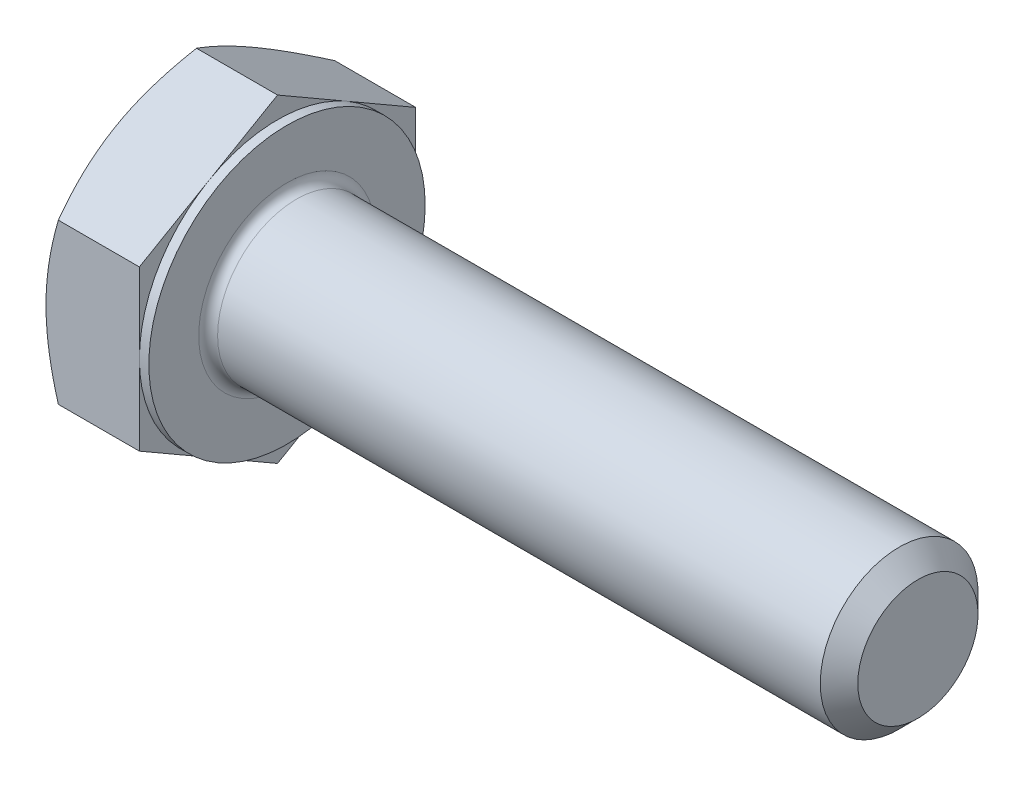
ISO-10303-21;
HEADER;
FILE_DESCRIPTION(('STEP AP214'),'2;1');
FILE_NAME('part.step','',(''),(''),'','','');
FILE_SCHEMA(('AUTOMOTIVE_DESIGN { 1 0 10303 214 1 1 1 1 }'));
ENDSEC;
DATA;
#1=APPLICATION_CONTEXT('core data for automotive mechanical design processes');
#2=APPLICATION_PROTOCOL_DEFINITION('international standard','automotive_design',2000,#1);
#3=PRODUCT_CONTEXT('',#1,'mechanical');
#4=PRODUCT('Part','Part','',(#3));
#5=PRODUCT_RELATED_PRODUCT_CATEGORY('part','',(#4));
#6=PRODUCT_DEFINITION_FORMATION('','',#4);
#7=PRODUCT_DEFINITION_CONTEXT('part definition',#1,'design');
#8=PRODUCT_DEFINITION('design','',#6,#7);
#9=PRODUCT_DEFINITION_SHAPE('','',#8);
#10=(LENGTH_UNIT() NAMED_UNIT(*) SI_UNIT(.MILLI.,.METRE.));
#11=(NAMED_UNIT(*) PLANE_ANGLE_UNIT() SI_UNIT($,.RADIAN.));
#12=(NAMED_UNIT(*) SI_UNIT($,.STERADIAN.) SOLID_ANGLE_UNIT());
#13=UNCERTAINTY_MEASURE_WITH_UNIT(LENGTH_MEASURE(1.E-05),#10,'distance_accuracy_value','');
#14=(GEOMETRIC_REPRESENTATION_CONTEXT(3) GLOBAL_UNCERTAINTY_ASSIGNED_CONTEXT((#13)) GLOBAL_UNIT_ASSIGNED_CONTEXT((#10,
#11,#12)) REPRESENTATION_CONTEXT('',''));
#15=CARTESIAN_POINT('',(0.,0.,0.));
#16=DIRECTION('',(0.,0.,1.));
#17=DIRECTION('',(1.,0.,0.));
#18=AXIS2_PLACEMENT_3D('',#15,#16,#17);
#19=CARTESIAN_POINT('',(4.1402,6.42313721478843,0.));
#20=DIRECTION('',(1.,0.,0.));
#21=DIRECTION('',(0.,0.,-1.));
#22=AXIS2_PLACEMENT_3D('',#19,#20,#21);
#23=PLANE('',#22);
#24=CARTESIAN_POINT('',(4.1402,0.,0.));
#25=DIRECTION('',(1.,0.,0.));
#26=DIRECTION('',(0.,0.,-1.));
#27=AXIS2_PLACEMENT_3D('',#24,#25,#26);
#28=CIRCLE('',#27,3.556);
#29=CARTESIAN_POINT('',(4.1402,0.,-3.556));
#30=VERTEX_POINT('',#29);
#31=EDGE_CURVE('E40',#30,#30,#28,.F.);
#32=ORIENTED_EDGE('',*,*,#31,.T.);
#33=EDGE_LOOP('',(#32));
#34=FACE_BOUND('',#33,.T.);
#35=CARTESIAN_POINT('',(4.1402,0.,0.));
#36=DIRECTION('',(1.,0.,0.));
#37=DIRECTION('',(0.,0.,-1.));
#38=AXIS2_PLACEMENT_3D('',#35,#36,#37);
#39=CIRCLE('',#38,5.5626);
#40=CARTESIAN_POINT('',(4.1402,0.,-5.5626));
#41=VERTEX_POINT('',#40);
#42=EDGE_CURVE('E291',#41,#41,#39,.T.);
#43=ORIENTED_EDGE('',*,*,#42,.T.);
#44=EDGE_LOOP('',(#43));
#45=FACE_BOUND('',#44,.T.);
#46=ADVANCED_FACE('F32',(#34,#45),#23,.T.);
#47=CARTESIAN_POINT('',(0.,0.,0.));
#48=DIRECTION('',(-1.,0.,0.));
#49=DIRECTION('',(0.,0.,1.));
#50=AXIS2_PLACEMENT_3D('',#47,#48,#49);
#51=CYLINDRICAL_SURFACE('',#50,3.175);
#52=CARTESIAN_POINT('',(4.5212,0.,0.));
#53=DIRECTION('',(1.,0.,0.));
#54=DIRECTION('',(0.,0.,-1.));
#55=AXIS2_PLACEMENT_3D('',#52,#53,#54);
#56=CIRCLE('',#55,3.175);
#57=CARTESIAN_POINT('',(4.5212,0.,-3.175));
#58=VERTEX_POINT('',#57);
#59=EDGE_CURVE('E11',#58,#58,#56,.T.);
#60=ORIENTED_EDGE('',*,*,#59,.T.);
#61=EDGE_LOOP('',(#60));
#62=FACE_BOUND('',#61,.T.);
#63=CARTESIAN_POINT('',(28.78455,0.,0.));
#64=DIRECTION('',(-1.,0.,0.));
#65=DIRECTION('',(0.,0.,1.));
#66=AXIS2_PLACEMENT_3D('',#63,#64,#65);
#67=CIRCLE('',#66,3.175);
#68=CARTESIAN_POINT('',(28.78455,0.,3.175));
#69=VERTEX_POINT('',#68);
#70=EDGE_CURVE('E270',#69,#69,#67,.T.);
#71=ORIENTED_EDGE('',*,*,#70,.T.);
#72=EDGE_LOOP('',(#71));
#73=FACE_BOUND('',#72,.T.);
#74=ADVANCED_FACE('F244',(#62,#73),#51,.T.);
#75=CARTESIAN_POINT('',(29.5402,0.,0.));
#76=DIRECTION('',(-1.,0.,0.));
#77=DIRECTION('',(0.,0.,1.));
#78=AXIS2_PLACEMENT_3D('',#75,#76,#77);
#79=CONICAL_SURFACE('',#78,2.41935,0.785398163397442);
#80=ORIENTED_EDGE('',*,*,#70,.F.);
#81=EDGE_LOOP('',(#80));
#82=FACE_BOUND('',#81,.T.);
#83=CARTESIAN_POINT('',(29.5402,0.,0.));
#84=DIRECTION('',(-1.,0.,0.));
#85=DIRECTION('',(0.,0.,1.));
#86=AXIS2_PLACEMENT_3D('',#83,#84,#85);
#87=CIRCLE('',#86,2.41935);
#88=CARTESIAN_POINT('',(29.5402,0.,2.41935));
#89=VERTEX_POINT('',#88);
#90=EDGE_CURVE('E268',#89,#89,#87,.T.);
#91=ORIENTED_EDGE('',*,*,#90,.T.);
#92=EDGE_LOOP('',(#91));
#93=FACE_BOUND('',#92,.T.);
#94=ADVANCED_FACE('F249',(#82,#93),#79,.T.);
#95=CARTESIAN_POINT('',(29.5402,0.,0.));
#96=DIRECTION('',(-1.,0.,0.));
#97=DIRECTION('',(0.,0.,1.));
#98=AXIS2_PLACEMENT_3D('',#95,#96,#97);
#99=PLANE('',#98);
#100=ORIENTED_EDGE('',*,*,#90,.F.);
#101=EDGE_LOOP('',(#100));
#102=FACE_BOUND('',#101,.T.);
#103=ADVANCED_FACE('F256',(#102),#99,.F.);
#104=CARTESIAN_POINT('',(3.7592,5.5626,0.));
#105=DIRECTION('',(1.,0.,0.));
#106=DIRECTION('',(0.,0.,-1.));
#107=AXIS2_PLACEMENT_3D('',#104,#105,#106);
#108=PLANE('',#107);
#109=DIRECTION('',(0.,0.500000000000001,0.866025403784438));
#110=VECTOR('',#109,1.);
#111=CARTESIAN_POINT('',(3.7592,3.21156860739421,-5.5626));
#112=LINE('',#111,#110);
#113=CARTESIAN_POINT('',(3.7592,3.21156860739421,-5.5626));
#114=VERTEX_POINT('',#113);
#115=CARTESIAN_POINT('',(3.7592,4.81735291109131,-2.78130000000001));
#116=VERTEX_POINT('',#115);
#117=EDGE_CURVE('E164',#114,#116,#112,.T.);
#118=ORIENTED_EDGE('',*,*,#117,.T.);
#119=CARTESIAN_POINT('',(3.7592,0.,0.));
#120=DIRECTION('',(-1.,0.,0.));
#121=DIRECTION('',(0.,0.,1.));
#122=AXIS2_PLACEMENT_3D('',#119,#120,#121);
#123=CIRCLE('',#122,5.5626);
#124=CARTESIAN_POINT('',(3.7592,0.,-5.5626));
#125=VERTEX_POINT('',#124);
#126=EDGE_CURVE('E47',#116,#125,#123,.T.);
#127=ORIENTED_EDGE('',*,*,#126,.T.);
#128=DIRECTION('',(0.,1.,0.));
#129=VECTOR('',#128,1.);
#130=CARTESIAN_POINT('',(3.7592,3.21156860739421,-5.5626));
#131=LINE('',#130,#129);
#132=EDGE_CURVE('E294',#125,#114,#131,.T.);
#133=ORIENTED_EDGE('',*,*,#132,.T.);
#134=EDGE_LOOP('',(#118,#127,#133));
#135=FACE_BOUND('',#134,.T.);
#136=ADVANCED_FACE('F259',(#135),#108,.T.);
#137=CARTESIAN_POINT('',(3.7592,6.42313721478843,0.));
#138=VERTEX_POINT('',#137);
#139=EDGE_CURVE('E162',#116,#138,#112,.T.);
#140=ORIENTED_EDGE('',*,*,#139,.T.);
#141=DIRECTION('',(0.,-0.500000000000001,0.866025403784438));
#142=VECTOR('',#141,1.);
#143=CARTESIAN_POINT('',(3.7592,6.42313721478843,0.));
#144=LINE('',#143,#142);
#145=CARTESIAN_POINT('',(3.7592,4.81735291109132,2.7813));
#146=VERTEX_POINT('',#145);
#147=EDGE_CURVE('E161',#138,#146,#144,.T.);
#148=ORIENTED_EDGE('',*,*,#147,.T.);
#149=EDGE_CURVE('E150',#146,#116,#123,.T.);
#150=ORIENTED_EDGE('',*,*,#149,.T.);
#151=EDGE_LOOP('',(#140,#148,#150));
#152=FACE_BOUND('',#151,.T.);
#153=ADVANCED_FACE('F264',(#152),#108,.T.);
#154=CARTESIAN_POINT('',(3.7592,3.21156860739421,5.5626));
#155=VERTEX_POINT('',#154);
#156=EDGE_CURVE('E129',#146,#155,#144,.T.);
#157=ORIENTED_EDGE('',*,*,#156,.T.);
#158=DIRECTION('',(0.,-1.,0.));
#159=VECTOR('',#158,1.);
#160=CARTESIAN_POINT('',(3.7592,3.21156860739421,5.5626));
#161=LINE('',#160,#159);
#162=CARTESIAN_POINT('',(3.7592,0.,5.5626));
#163=VERTEX_POINT('',#162);
#164=EDGE_CURVE('E123',#155,#163,#161,.T.);
#165=ORIENTED_EDGE('',*,*,#164,.T.);
#166=EDGE_CURVE('E127',#163,#146,#123,.T.);
#167=ORIENTED_EDGE('',*,*,#166,.T.);
#168=EDGE_LOOP('',(#157,#165,#167));
#169=FACE_BOUND('',#168,.T.);
#170=ADVANCED_FACE('F125',(#169),#108,.T.);
#171=CARTESIAN_POINT('',(3.7592,-3.2115686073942,5.5626));
#172=VERTEX_POINT('',#171);
#173=EDGE_CURVE('E133',#163,#172,#161,.T.);
#174=ORIENTED_EDGE('',*,*,#173,.T.);
#175=DIRECTION('',(0.,-0.500000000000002,-0.866025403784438));
#176=VECTOR('',#175,1.);
#177=CARTESIAN_POINT('',(3.7592,-6.42313721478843,0.));
#178=LINE('',#177,#176);
#179=CARTESIAN_POINT('',(3.7592,-4.81735291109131,2.78130000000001));
#180=VERTEX_POINT('',#179);
#181=EDGE_CURVE('E140',#172,#180,#178,.T.);
#182=ORIENTED_EDGE('',*,*,#181,.T.);
#183=EDGE_CURVE('E137',#180,#163,#123,.T.);
#184=ORIENTED_EDGE('',*,*,#183,.T.);
#185=EDGE_LOOP('',(#174,#182,#184));
#186=FACE_BOUND('',#185,.T.);
#187=ADVANCED_FACE('F138',(#186),#108,.T.);
#188=CARTESIAN_POINT('',(3.7592,-6.42313721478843,0.));
#189=VERTEX_POINT('',#188);
#190=EDGE_CURVE('E156',#180,#189,#178,.T.);
#191=ORIENTED_EDGE('',*,*,#190,.T.);
#192=DIRECTION('',(0.,0.5,-0.866025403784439));
#193=VECTOR('',#192,1.);
#194=CARTESIAN_POINT('',(3.7592,-3.21156860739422,-5.5626));
#195=LINE('',#194,#193);
#196=CARTESIAN_POINT('',(3.7592,-4.81735291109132,-2.7813));
#197=VERTEX_POINT('',#196);
#198=EDGE_CURVE('E332',#189,#197,#195,.T.);
#199=ORIENTED_EDGE('',*,*,#198,.T.);
#200=EDGE_CURVE('E144',#197,#180,#123,.T.);
#201=ORIENTED_EDGE('',*,*,#200,.T.);
#202=EDGE_LOOP('',(#191,#199,#201));
#203=FACE_BOUND('',#202,.T.);
#204=ADVANCED_FACE('F333',(#203),#108,.T.);
#205=CARTESIAN_POINT('',(3.7592,-3.21156860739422,-5.5626));
#206=VERTEX_POINT('',#205);
#207=EDGE_CURVE('E151',#197,#206,#195,.T.);
#208=ORIENTED_EDGE('',*,*,#207,.T.);
#209=EDGE_CURVE('E295',#206,#125,#131,.T.);
#210=ORIENTED_EDGE('',*,*,#209,.T.);
#211=EDGE_CURVE('E302',#125,#197,#123,.T.);
#212=ORIENTED_EDGE('',*,*,#211,.T.);
#213=EDGE_LOOP('',(#208,#210,#212));
#214=FACE_BOUND('',#213,.T.);
#215=ADVANCED_FACE('F265',(#214),#108,.T.);
#216=CARTESIAN_POINT('',(0.,0.,0.));
#217=DIRECTION('',(-1.,0.,0.));
#218=DIRECTION('',(0.,0.,1.));
#219=AXIS2_PLACEMENT_3D('',#216,#217,#218);
#220=CYLINDRICAL_SURFACE('',#219,5.5626);
#221=ORIENTED_EDGE('',*,*,#126,.F.);
#222=ORIENTED_EDGE('',*,*,#149,.F.);
#223=ORIENTED_EDGE('',*,*,#166,.F.);
#224=ORIENTED_EDGE('',*,*,#183,.F.);
#225=ORIENTED_EDGE('',*,*,#200,.F.);
#226=ORIENTED_EDGE('',*,*,#211,.F.);
#227=EDGE_LOOP('',(#221,#222,#223,#224,#225,#226));
#228=FACE_BOUND('',#227,.T.);
#229=ORIENTED_EDGE('',*,*,#42,.F.);
#230=EDGE_LOOP('',(#229));
#231=FACE_BOUND('',#230,.T.);
#232=ADVANCED_FACE('F147',(#228,#231),#220,.T.);
#233=CARTESIAN_POINT('',(0.,6.42313721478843,0.));
#234=DIRECTION('',(1.,0.,0.));
#235=DIRECTION('',(0.,0.,-1.));
#236=AXIS2_PLACEMENT_3D('',#233,#234,#235);
#237=PLANE('',#236);
#238=CARTESIAN_POINT('',(0.,0.,0.));
#239=DIRECTION('',(1.,0.,0.));
#240=DIRECTION('',(0.,0.,-1.));
#241=AXIS2_PLACEMENT_3D('',#238,#239,#240);
#242=CIRCLE('',#241,5.5626);
#243=CARTESIAN_POINT('',(0.,0.,-5.5626));
#244=VERTEX_POINT('',#243);
#245=CARTESIAN_POINT('',(0.,4.81735291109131,-2.78130000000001));
#246=VERTEX_POINT('',#245);
#247=EDGE_CURVE('E290',#244,#246,#242,.T.);
#248=ORIENTED_EDGE('',*,*,#247,.F.);
#249=CARTESIAN_POINT('',(0.,-4.81735291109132,-2.7813));
#250=VERTEX_POINT('',#249);
#251=EDGE_CURVE('E286',#250,#244,#242,.T.);
#252=ORIENTED_EDGE('',*,*,#251,.F.);
#253=CARTESIAN_POINT('',(0.,-4.81735291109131,2.78130000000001));
#254=VERTEX_POINT('',#253);
#255=EDGE_CURVE('E289',#254,#250,#242,.T.);
#256=ORIENTED_EDGE('',*,*,#255,.F.);
#257=CARTESIAN_POINT('',(0.,0.,5.5626));
#258=VERTEX_POINT('',#257);
#259=EDGE_CURVE('E325',#258,#254,#242,.T.);
#260=ORIENTED_EDGE('',*,*,#259,.F.);
#261=CARTESIAN_POINT('',(0.,0.,0.));
#262=DIRECTION('',(-1.,0.,0.));
#263=DIRECTION('',(0.,0.,1.));
#264=AXIS2_PLACEMENT_3D('',#261,#262,#263);
#265=CIRCLE('',#264,5.5626);
#266=CARTESIAN_POINT('',(0.,4.81735291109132,2.7813));
#267=VERTEX_POINT('',#266);
#268=EDGE_CURVE('E165',#258,#267,#265,.T.);
#269=ORIENTED_EDGE('',*,*,#268,.T.);
#270=EDGE_CURVE('E348',#246,#267,#242,.T.);
#271=ORIENTED_EDGE('',*,*,#270,.F.);
#272=EDGE_LOOP('',(#248,#252,#256,#260,#269,#271));
#273=FACE_BOUND('',#272,.T.);
#274=ADVANCED_FACE('F194',(#273),#237,.F.);
#275=CARTESIAN_POINT('',(0.,0.,0.));
#276=DIRECTION('',(1.,0.,0.));
#277=DIRECTION('',(0.,0.,-1.));
#278=AXIS2_PLACEMENT_3D('',#275,#276,#277);
#279=CONICAL_SURFACE('',#278,5.5626,1.0471975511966);
#280=CARTESIAN_POINT('',(0.496898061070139,3.21145313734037,5.5628));
#281=CARTESIAN_POINT('',(0.456146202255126,3.28204724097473,5.44052742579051));
#282=CARTESIAN_POINT('',(0.417243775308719,3.35290455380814,5.31779895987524));
#283=CARTESIAN_POINT('',(0.343647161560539,3.49519461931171,5.07134533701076));
#284=CARTESIAN_POINT('',(0.308954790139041,3.56662760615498,4.9476197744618));
#285=CARTESIAN_POINT('',(0.211873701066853,3.78207031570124,4.57446205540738));
#286=CARTESIAN_POINT('',(0.156654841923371,3.92693047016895,4.32355690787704));
#287=CARTESIAN_POINT('',(0.0919037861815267,4.14371105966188,3.94808191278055));
#288=CARTESIAN_POINT('',(0.0734579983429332,4.21498376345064,3.82463396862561));
#289=CARTESIAN_POINT('',(0.0425268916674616,4.3578512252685,3.57718026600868));
#290=CARTESIAN_POINT('',(0.0300410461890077,4.42944595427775,3.45317455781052));
#291=CARTESIAN_POINT('',(0.0113480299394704,4.57275976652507,3.20494775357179));
#292=CARTESIAN_POINT('',(0.00513373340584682,4.64447861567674,3.08072706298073));
#293=CARTESIAN_POINT('',(-0.000889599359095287,4.78797861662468,2.8321777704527));
#294=CARTESIAN_POINT('',(-0.000698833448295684,4.85975976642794,2.70784917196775));
#295=CARTESIAN_POINT('',(0.00862810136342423,5.05641945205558,2.36722460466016));
#296=CARTESIAN_POINT('',(0.0242873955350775,5.18123362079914,2.15104012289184));
#297=CARTESIAN_POINT('',(0.0739443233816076,5.4300329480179,1.72010704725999));
#298=CARTESIAN_POINT('',(0.10795893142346,5.55401723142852,1.50535996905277));
#299=CARTESIAN_POINT('',(0.19298604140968,5.80331731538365,1.0735595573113));
#300=CARTESIAN_POINT('',(0.244358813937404,5.92860165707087,0.856560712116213));
#301=CARTESIAN_POINT('',(0.360954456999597,6.17730193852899,0.425799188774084));
#302=CARTESIAN_POINT('',(0.426149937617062,6.30072106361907,0.212030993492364));
#303=CARTESIAN_POINT('',(0.496898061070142,6.42325268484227,-0.000199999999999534));
#304=B_SPLINE_CURVE_WITH_KNOTS('',3,(#280,#281,#282,#283,#284,#285,#286,#287,#288,#289,#290,
#291,#292,#293,#294,#295,#296,#297,#298,#299,#300,#301,#302,#303),.UNSPECIFIED.,.F.,.F.,(4,2,2,
2,2,2,2,2,2,2,2,4),(0.,0.44082011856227,0.881829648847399,1.76568130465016,2.19678242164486,
2.62784543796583,3.05841812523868,3.48897751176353,4.23854798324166,4.98881282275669,
5.75571809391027,6.52111769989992),.UNSPECIFIED.);
#305=CARTESIAN_POINT('',(0.496831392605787,6.42313721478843,0.));
#306=VERTEX_POINT('',#305);
#307=EDGE_CURVE('E213',#267,#306,#304,.T.);
#308=ORIENTED_EDGE('',*,*,#307,.T.);
#309=CARTESIAN_POINT('',(0.496898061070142,6.42325268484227,0.0002));
#310=CARTESIAN_POINT('',(0.45614620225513,6.35265858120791,-0.12207257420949));
#311=CARTESIAN_POINT('',(0.417243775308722,6.2818012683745,-0.244801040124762));
#312=CARTESIAN_POINT('',(0.343647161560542,6.13951120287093,-0.491254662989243));
#313=CARTESIAN_POINT('',(0.308954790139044,6.06807821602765,-0.614980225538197));
#314=CARTESIAN_POINT('',(0.211873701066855,5.85263550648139,-0.98813794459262));
#315=CARTESIAN_POINT('',(0.156654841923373,5.70777535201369,-1.23904309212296));
#316=CARTESIAN_POINT('',(0.0919037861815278,5.49099476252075,-1.61451808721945));
#317=CARTESIAN_POINT('',(0.0734579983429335,5.41972205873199,-1.7379660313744));
#318=CARTESIAN_POINT('',(0.0425268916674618,5.27685459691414,-1.98541973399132));
#319=CARTESIAN_POINT('',(0.0300410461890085,5.20525986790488,-2.10942544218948));
#320=CARTESIAN_POINT('',(0.011348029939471,5.06194605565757,-2.35765224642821));
#321=CARTESIAN_POINT('',(0.00513373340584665,4.9902272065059,-2.48187293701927));
#322=CARTESIAN_POINT('',(-0.000889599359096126,4.84672720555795,-2.7304222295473));
#323=CARTESIAN_POINT('',(-0.000698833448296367,4.7749460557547,-2.85475082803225));
#324=CARTESIAN_POINT('',(0.00862810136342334,4.57828637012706,-3.19537539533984));
#325=CARTESIAN_POINT('',(0.0242873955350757,4.4534722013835,-3.41155987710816));
#326=CARTESIAN_POINT('',(0.0739443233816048,4.20467287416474,-3.84249295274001));
#327=CARTESIAN_POINT('',(0.107958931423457,4.08068859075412,-4.05724003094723));
#328=CARTESIAN_POINT('',(0.192986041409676,3.83138850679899,-4.4890404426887));
#329=CARTESIAN_POINT('',(0.2443588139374,3.70610416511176,-4.70603928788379));
#330=CARTESIAN_POINT('',(0.360954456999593,3.45740388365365,-5.13680081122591));
#331=CARTESIAN_POINT('',(0.426149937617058,3.33398475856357,-5.35056900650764));
#332=CARTESIAN_POINT('',(0.496898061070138,3.21145313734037,-5.5628));
#333=B_SPLINE_CURVE_WITH_KNOTS('',3,(#309,#310,#311,#312,#313,#314,#315,#316,#317,#318,#319,
#320,#321,#322,#323,#324,#325,#326,#327,#328,#329,#330,#331,#332),.UNSPECIFIED.,.F.,.F.,(4,2,2,
2,2,2,2,2,2,2,2,4),(0.,0.44082011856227,0.881829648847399,1.76568130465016,2.19678242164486,
2.62784543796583,3.05841812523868,3.48897751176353,4.23854798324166,4.98881282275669,
5.75571809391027,6.52111769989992),.UNSPECIFIED.);
#334=EDGE_CURVE('E55',#306,#246,#333,.T.);
#335=ORIENTED_EDGE('',*,*,#334,.T.);
#336=ORIENTED_EDGE('',*,*,#270,.T.);
#337=EDGE_LOOP('',(#308,#335,#336));
#338=FACE_BOUND('',#337,.T.);
#339=ADVANCED_FACE('F349',(#338),#279,.T.);
#340=CARTESIAN_POINT('',(2.76867892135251,-8.73770923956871,5.5626));
#341=CARTESIAN_POINT('',(2.64990389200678,-8.49376920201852,5.5626));
#342=CARTESIAN_POINT('',(2.53223615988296,-8.24928090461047,5.5626));
#343=CARTESIAN_POINT('',(2.29973601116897,-7.75891658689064,5.5626));
#344=CARTESIAN_POINT('',(2.18490402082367,-7.51304036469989,5.5626));
#345=CARTESIAN_POINT('',(1.95814206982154,-7.01839500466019,5.5626));
#346=CARTESIAN_POINT('',(1.8462303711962,-6.76961746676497,5.5626));
#347=CARTESIAN_POINT('',(1.62684171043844,-6.27012180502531,5.5626));
#348=CARTESIAN_POINT('',(1.51936454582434,-6.01940377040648,5.5626));
#349=CARTESIAN_POINT('',(1.30650332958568,-5.50718489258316,5.5626));
#350=CARTESIAN_POINT('',(1.20131017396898,-5.24560429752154,5.5626));
#351=CARTESIAN_POINT('',(0.998619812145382,-4.71942399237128,5.5626));
#352=CARTESIAN_POINT('',(0.901123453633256,-4.45482395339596,5.5626));
#353=CARTESIAN_POINT('',(0.716304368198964,-3.92264484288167,5.5626));
#354=CARTESIAN_POINT('',(0.628961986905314,-3.6550726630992,5.5626));
#355=CARTESIAN_POINT('',(0.467180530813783,-3.11608883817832,5.5626));
#356=CARTESIAN_POINT('',(0.392737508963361,-2.84467839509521,5.5626));
#357=CARTESIAN_POINT('',(0.260643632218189,-2.29937288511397,5.5626));
#358=CARTESIAN_POINT('',(0.202899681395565,-2.02550072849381,5.5626));
#359=CARTESIAN_POINT('',(0.107411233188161,-1.47419871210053,5.5626));
#360=CARTESIAN_POINT('',(0.0696645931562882,-1.19676923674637,5.5626));
#361=CARTESIAN_POINT('',(0.0305431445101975,-0.780906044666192,5.5626));
#362=CARTESIAN_POINT('',(0.0204298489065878,-0.643261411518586,5.5626));
#363=CARTESIAN_POINT('',(0.00603400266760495,-0.367672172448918,5.5626));
#364=CARTESIAN_POINT('',(0.00175090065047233,-0.229727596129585,5.5626));
#365=CARTESIAN_POINT('',(-0.000877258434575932,0.0462298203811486,5.5626));
#366=CARTESIAN_POINT('',(0.000778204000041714,0.184242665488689,5.5626));
#367=CARTESIAN_POINT('',(0.00998447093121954,0.460061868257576,5.5626));
#368=CARTESIAN_POINT('',(0.0175350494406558,0.597868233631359,5.5626));
#369=CARTESIAN_POINT('',(0.0423475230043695,0.925701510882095,5.5626));
#370=CARTESIAN_POINT('',(0.0622197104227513,1.11553529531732,5.5626));
#371=CARTESIAN_POINT('',(0.112092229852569,1.49385755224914,5.5626));
#372=CARTESIAN_POINT('',(0.142093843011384,1.6823458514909,5.5626));
#373=CARTESIAN_POINT('',(0.245707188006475,2.24553584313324,5.5626));
#374=CARTESIAN_POINT('',(0.332911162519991,2.61777353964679,5.5626));
#375=CARTESIAN_POINT('',(0.484971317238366,3.17463937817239,5.5626));
#376=CARTESIAN_POINT('',(0.539950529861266,3.36213116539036,5.5626));
#377=CARTESIAN_POINT('',(0.655825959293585,3.73529534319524,5.5626));
#378=CARTESIAN_POINT('',(0.716722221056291,3.92096771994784,5.5626));
#379=CARTESIAN_POINT('',(0.843437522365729,4.29054955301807,5.5626));
#380=CARTESIAN_POINT('',(0.909255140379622,4.47445950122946,5.5626));
#381=CARTESIAN_POINT('',(1.04501805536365,4.8407399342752,5.5626));
#382=CARTESIAN_POINT('',(1.11496326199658,5.02311045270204,5.5626));
#383=CARTESIAN_POINT('',(1.3067033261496,5.50920768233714,5.5626));
#384=CARTESIAN_POINT('',(1.43161029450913,5.8117055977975,5.5626));
#385=CARTESIAN_POINT('',(1.68864300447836,6.41363008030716,5.5626));
#386=CARTESIAN_POINT('',(1.820769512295,6.71305631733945,5.5626));
#387=CARTESIAN_POINT('',(2.09055145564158,7.30953269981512,5.5626));
#388=CARTESIAN_POINT('',(2.22820891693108,7.60658192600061,5.5626));
#389=CARTESIAN_POINT('',(2.50774521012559,8.19866668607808,5.5626));
#390=CARTESIAN_POINT('',(2.64962387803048,8.49370229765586,5.5626));
#391=CARTESIAN_POINT('',(2.93691564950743,9.082615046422,5.5626));
#392=CARTESIAN_POINT('',(3.08233392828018,9.37648965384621,5.5626));
#393=CARTESIAN_POINT('',(3.37581584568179,9.96291541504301,5.5626));
#394=CARTESIAN_POINT('',(3.52387950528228,10.2554665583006,5.5626));
#395=CARTESIAN_POINT('',(3.97117391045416,11.1313757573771,5.5626));
#396=CARTESIAN_POINT('',(4.2735705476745,11.7131163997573,5.5626));
#397=CARTESIAN_POINT('',(4.85224603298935,12.8132069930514,5.5626));
#398=CARTESIAN_POINT('',(5.12796685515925,13.3318519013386,5.5626));
#399=CARTESIAN_POINT('',(5.68275678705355,14.3673864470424,5.5626));
#400=CARTESIAN_POINT('',(5.9618260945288,14.8842759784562,5.5626));
#401=CARTESIAN_POINT('',(6.52152736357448,15.9150112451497,5.5626));
#402=CARTESIAN_POINT('',(6.80215119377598,16.4288614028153,5.5626));
#403=CARTESIAN_POINT('',(7.36530536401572,17.4554650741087,5.5626));
#404=CARTESIAN_POINT('',(7.64783555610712,17.9682186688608,5.5626));
#405=CARTESIAN_POINT('',(7.93106072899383,18.4805856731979,5.5626));
#406=B_SPLINE_CURVE_WITH_KNOTS('',3,(#340,#341,#342,#343,#344,#345,#346,#347,#348,#349,#350,
#351,#352,#353,#354,#355,#356,#357,#358,#359,#360,#361,#362,#363,#364,#365,#366,#367,#368,#369,
#370,#371,#372,#373,#374,#375,#376,#377,#378,#379,#380,#381,#382,#383,#384,#385,#386,#387,#388,
#389,#390,#391,#392,#393,#394,#395,#396,#397,#398,#399,#400,#401,#402,#403,#404,#405),
.UNSPECIFIED.,.F.,.F.,(4,2,2,2,2,2,2,2,2,2,2,2,2,2,2,2,2,2,2,2,2,2,2,2,2,2,2,2,2,2,2,2,4),(0.,
0.813967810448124,1.62805723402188,2.44639311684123,3.26469159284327,4.11041719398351,
4.95623581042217,5.80038896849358,6.64428336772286,7.48337819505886,8.32238309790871,
8.73632540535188,9.15022856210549,9.56416792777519,9.97809142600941,10.5503838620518,
11.1227487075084,12.2680451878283,12.8541526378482,13.4402645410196,14.0262077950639,
14.6121382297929,15.5938140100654,16.575594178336,17.5577372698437,18.5398422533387,
19.5234814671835,20.5071284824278,22.4739984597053,24.2361240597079,25.998354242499,
27.7548024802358,29.5111159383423),.UNSPECIFIED.);
#407=CARTESIAN_POINT('',(0.496831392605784,3.21156860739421,5.5626));
#408=VERTEX_POINT('',#407);
#409=EDGE_CURVE('E225',#258,#408,#406,.T.);
#410=ORIENTED_EDGE('',*,*,#409,.T.);
#411=EDGE_CURVE('E224',#408,#267,#304,.T.);
#412=ORIENTED_EDGE('',*,*,#411,.T.);
#413=ORIENTED_EDGE('',*,*,#268,.F.);
#414=EDGE_LOOP('',(#410,#412,#413));
#415=FACE_BOUND('',#414,.T.);
#416=ADVANCED_FACE('F319',(#415),#279,.T.);
#417=CARTESIAN_POINT('',(0.496831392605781,-3.2115686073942,5.5626));
#418=VERTEX_POINT('',#417);
#419=EDGE_CURVE('E271',#418,#258,#406,.T.);
#420=ORIENTED_EDGE('',*,*,#419,.T.);
#421=ORIENTED_EDGE('',*,*,#259,.T.);
#422=CARTESIAN_POINT('',(0.496898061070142,-6.42325268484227,-0.000200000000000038));
#423=CARTESIAN_POINT('',(0.45614620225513,-6.35265858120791,0.122072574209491));
#424=CARTESIAN_POINT('',(0.417243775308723,-6.2818012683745,0.244801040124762));
#425=CARTESIAN_POINT('',(0.343647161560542,-6.13951120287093,0.491254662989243));
#426=CARTESIAN_POINT('',(0.308954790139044,-6.06807821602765,0.614980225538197));
#427=CARTESIAN_POINT('',(0.211873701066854,-5.85263550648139,0.988137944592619));
#428=CARTESIAN_POINT('',(0.156654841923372,-5.70777535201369,1.23904309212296));
#429=CARTESIAN_POINT('',(0.091903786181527,-5.49099476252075,1.61451808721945));
#430=CARTESIAN_POINT('',(0.0734579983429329,-5.41972205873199,1.73796603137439));
#431=CARTESIAN_POINT('',(0.0425268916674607,-5.27685459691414,1.98541973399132));
#432=CARTESIAN_POINT('',(0.0300410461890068,-5.20525986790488,2.10942544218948));
#433=CARTESIAN_POINT('',(0.011348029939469,-5.06194605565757,2.35765224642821));
#434=CARTESIAN_POINT('',(0.00513373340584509,-4.9902272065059,2.48187293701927));
#435=CARTESIAN_POINT('',(-0.000889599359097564,-4.84672720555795,2.7304222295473));
#436=CARTESIAN_POINT('',(-0.000698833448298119,-4.77494605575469,2.85475082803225));
#437=CARTESIAN_POINT('',(0.00862810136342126,-4.57828637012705,3.19537539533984));
#438=CARTESIAN_POINT('',(0.0242873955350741,-4.4534722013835,3.41155987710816));
#439=CARTESIAN_POINT('',(0.0739443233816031,-4.20467287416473,3.84249295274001));
#440=CARTESIAN_POINT('',(0.107958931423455,-4.08068859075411,4.05724003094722));
#441=CARTESIAN_POINT('',(0.192986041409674,-3.83138850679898,4.4890404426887));
#442=CARTESIAN_POINT('',(0.244358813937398,-3.70610416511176,4.70603928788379));
#443=CARTESIAN_POINT('',(0.360954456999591,-3.45740388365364,5.13680081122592));
#444=CARTESIAN_POINT('',(0.426149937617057,-3.33398475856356,5.35056900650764));
#445=CARTESIAN_POINT('',(0.496898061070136,-3.21145313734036,5.5628));
#446=B_SPLINE_CURVE_WITH_KNOTS('',3,(#422,#423,#424,#425,#426,#427,#428,#429,#430,#431,#432,
#433,#434,#435,#436,#437,#438,#439,#440,#441,#442,#443,#444,#445),.UNSPECIFIED.,.F.,.F.,(4,2,2,
2,2,2,2,2,2,2,2,4),(0.,0.44082011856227,0.8818296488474,1.76568130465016,2.19678242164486,
2.62784543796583,3.05841812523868,3.48897751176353,4.23854798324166,4.9888128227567,
5.75571809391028,6.52111769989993),.UNSPECIFIED.);
#447=EDGE_CURVE('E215',#254,#418,#446,.T.);
#448=ORIENTED_EDGE('',*,*,#447,.T.);
#449=EDGE_LOOP('',(#420,#421,#448));
#450=FACE_BOUND('',#449,.T.);
#451=ADVANCED_FACE('F183',(#450),#279,.T.);
#452=CARTESIAN_POINT('',(0.496831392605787,-6.42313721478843,0.));
#453=VERTEX_POINT('',#452);
#454=EDGE_CURVE('E208',#453,#254,#446,.T.);
#455=ORIENTED_EDGE('',*,*,#454,.T.);
#456=ORIENTED_EDGE('',*,*,#255,.T.);
#457=CARTESIAN_POINT('',(0.496898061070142,-3.21145313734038,-5.5628));
#458=CARTESIAN_POINT('',(0.456146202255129,-3.28204724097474,-5.44052742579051));
#459=CARTESIAN_POINT('',(0.417243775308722,-3.35290455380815,-5.31779895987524));
#460=CARTESIAN_POINT('',(0.343647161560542,-3.49519461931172,-5.07134533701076));
#461=CARTESIAN_POINT('',(0.308954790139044,-3.56662760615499,-4.9476197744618));
#462=CARTESIAN_POINT('',(0.211873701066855,-3.78207031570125,-4.57446205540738));
#463=CARTESIAN_POINT('',(0.156654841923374,-3.92693047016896,-4.32355690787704));
#464=CARTESIAN_POINT('',(0.0919037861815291,-4.14371105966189,-3.94808191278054));
#465=CARTESIAN_POINT('',(0.0734579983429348,-4.21498376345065,-3.8246339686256));
#466=CARTESIAN_POINT('',(0.0425268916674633,-4.3578512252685,-3.57718026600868));
#467=CARTESIAN_POINT('',(0.0300410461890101,-4.42944595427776,-3.45317455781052));
#468=CARTESIAN_POINT('',(0.0113480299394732,-4.57275976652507,-3.20494775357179));
#469=CARTESIAN_POINT('',(0.00513373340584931,-4.64447861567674,-3.08072706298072));
#470=CARTESIAN_POINT('',(-0.000889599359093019,-4.78797861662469,-2.8321777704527));
#471=CARTESIAN_POINT('',(-0.000698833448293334,-4.85975976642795,-2.70784917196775));
#472=CARTESIAN_POINT('',(0.00862810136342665,-5.05641945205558,-2.36722460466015));
#473=CARTESIAN_POINT('',(0.0242873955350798,-5.18123362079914,-2.15104012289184));
#474=CARTESIAN_POINT('',(0.0739443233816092,-5.4300329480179,-1.72010704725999));
#475=CARTESIAN_POINT('',(0.107958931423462,-5.55401723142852,-1.50535996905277));
#476=CARTESIAN_POINT('',(0.19298604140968,-5.80331731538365,-1.0735595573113));
#477=CARTESIAN_POINT('',(0.244358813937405,-5.92860165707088,-0.856560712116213));
#478=CARTESIAN_POINT('',(0.360954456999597,-6.17730193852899,-0.425799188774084));
#479=CARTESIAN_POINT('',(0.426149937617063,-6.30072106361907,-0.212030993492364));
#480=CARTESIAN_POINT('',(0.496898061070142,-6.42325268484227,0.000199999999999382));
#481=B_SPLINE_CURVE_WITH_KNOTS('',3,(#457,#458,#459,#460,#461,#462,#463,#464,#465,#466,#467,
#468,#469,#470,#471,#472,#473,#474,#475,#476,#477,#478,#479,#480),.UNSPECIFIED.,.F.,.F.,(4,2,2,
2,2,2,2,2,2,2,2,4),(0.,0.44082011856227,0.881829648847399,1.76568130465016,2.19678242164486,
2.62784543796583,3.05841812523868,3.48897751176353,4.23854798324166,4.98881282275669,
5.75571809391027,6.52111769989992),.UNSPECIFIED.);
#482=EDGE_CURVE('E214',#250,#453,#481,.T.);
#483=ORIENTED_EDGE('',*,*,#482,.T.);
#484=EDGE_LOOP('',(#455,#456,#483));
#485=FACE_BOUND('',#484,.T.);
#486=ADVANCED_FACE('F347',(#485),#279,.T.);
#487=CARTESIAN_POINT('',(0.496831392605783,3.21156860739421,-5.5626));
#488=VERTEX_POINT('',#487);
#489=EDGE_CURVE('E216',#246,#488,#333,.T.);
#490=ORIENTED_EDGE('',*,*,#489,.T.);
#491=CARTESIAN_POINT('',(2.76867892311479,-8.73770924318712,-5.5626));
#492=CARTESIAN_POINT('',(2.64990389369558,-8.49376920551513,-5.5626));
#493=CARTESIAN_POINT('',(2.53223616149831,-8.24928090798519,-5.5626));
#494=CARTESIAN_POINT('',(2.29973601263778,-7.75891659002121,-5.5626));
#495=CARTESIAN_POINT('',(2.1849040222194,-7.5130403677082,-5.5626));
#496=CARTESIAN_POINT('',(1.95814207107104,-7.01839500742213,-5.5626));
#497=CARTESIAN_POINT('',(1.84623037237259,-6.76961746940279,-5.5626));
#498=CARTESIAN_POINT('',(1.6268417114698,-6.27012180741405,-5.5626));
#499=CARTESIAN_POINT('',(1.51936454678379,-6.01940377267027,-5.5626));
#500=CARTESIAN_POINT('',(1.30650333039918,-5.50718489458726,-5.5626));
#501=CARTESIAN_POINT('',(1.20131017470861,-5.24560429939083,-5.5626));
#502=CARTESIAN_POINT('',(0.998619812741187,-4.71942399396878,-5.5626));
#503=CARTESIAN_POINT('',(0.901123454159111,-4.45482395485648,-5.5626));
#504=CARTESIAN_POINT('',(0.716304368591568,-3.92264484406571,-5.5626));
#505=CARTESIAN_POINT('',(0.628961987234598,-3.65507266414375,-5.5626));
#506=CARTESIAN_POINT('',(0.467180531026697,-3.11608883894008,-5.5626));
#507=CARTESIAN_POINT('',(0.392737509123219,-2.84467839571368,-5.5626));
#508=CARTESIAN_POINT('',(0.260643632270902,-2.29937288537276,-5.5626));
#509=CARTESIAN_POINT('',(0.202899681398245,-2.02550072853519,-5.5626));
#510=CARTESIAN_POINT('',(0.107411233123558,-1.47419871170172,-5.5626));
#511=CARTESIAN_POINT('',(0.0696645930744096,-1.19676923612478,-5.5626));
#512=CARTESIAN_POINT('',(0.0305431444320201,-0.780906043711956,-5.5626));
#513=CARTESIAN_POINT('',(0.0204298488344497,-0.643261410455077,-5.5626));
#514=CARTESIAN_POINT('',(0.00603400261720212,-0.36767217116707,-5.5626));
#515=CARTESIAN_POINT('',(0.00175090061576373,-0.229727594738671,-5.5626));
#516=CARTESIAN_POINT('',(-0.000877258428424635,0.0462298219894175,-5.5626));
#517=CARTESIAN_POINT('',(0.000778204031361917,0.184242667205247,-5.5626));
#518=CARTESIAN_POINT('',(0.00998447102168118,0.460061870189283,-5.5626));
#519=CARTESIAN_POINT('',(0.0175350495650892,0.597868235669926,-5.5626));
#520=CARTESIAN_POINT('',(0.0423475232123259,0.925701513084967,-5.5626));
#521=CARTESIAN_POINT('',(0.0622197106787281,1.11553529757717,-5.5626));
#522=CARTESIAN_POINT('',(0.112092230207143,1.49385755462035,-5.5626));
#523=CARTESIAN_POINT('',(0.142093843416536,1.68234585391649,-5.5626));
#524=CARTESIAN_POINT('',(0.245707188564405,2.24553584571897,-5.5626));
#525=CARTESIAN_POINT('',(0.3329111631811,2.61777354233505,-5.5626));
#526=CARTESIAN_POINT('',(0.484971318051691,3.174639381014,-5.5626));
#527=CARTESIAN_POINT('',(0.539950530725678,3.3621311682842,-5.5626));
#528=CARTESIAN_POINT('',(0.655825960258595,3.73529534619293,-5.5626));
#529=CARTESIAN_POINT('',(0.71672222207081,3.92096772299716,-5.5626));
#530=CARTESIAN_POINT('',(0.843437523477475,4.29054955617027,-5.5626));
#531=CARTESIAN_POINT('',(0.909255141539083,4.47445950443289,-5.5626));
#532=CARTESIAN_POINT('',(1.04501805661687,4.84073993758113,-5.5626));
#533=CARTESIAN_POINT('',(1.11496326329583,5.02311045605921,-5.5626));
#534=CARTESIAN_POINT('',(1.30670332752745,5.50920768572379,-5.5626));
#535=CARTESIAN_POINT('',(1.43161029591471,5.81170560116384,-5.5626));
#536=CARTESIAN_POINT('',(1.68864300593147,6.4136300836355,-5.5626));
#537=CARTESIAN_POINT('',(1.8207695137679,6.71305632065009,-5.5626));
#538=CARTESIAN_POINT('',(2.09055145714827,7.30953270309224,-5.5626));
#539=CARTESIAN_POINT('',(2.22820891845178,7.60658192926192,-5.5626));
#540=CARTESIAN_POINT('',(2.50774521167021,8.19866668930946,-5.5626));
#541=CARTESIAN_POINT('',(2.64962387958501,8.49370230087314,-5.5626));
#542=CARTESIAN_POINT('',(2.93691565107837,9.08261504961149,-5.5626));
#543=CARTESIAN_POINT('',(3.0823339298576,9.37648965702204,-5.5626));
#544=CARTESIAN_POINT('',(3.37581584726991,9.96291541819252,-5.5626));
#545=CARTESIAN_POINT('',(3.52387950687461,10.2554665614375,-5.5626));
#546=CARTESIAN_POINT('',(3.97117391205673,11.1313757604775,-5.5626));
#547=CARTESIAN_POINT('',(4.27357054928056,11.7131164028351,-5.5626));
#548=CARTESIAN_POINT('',(4.852246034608,12.8132069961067,-5.5626));
#549=CARTESIAN_POINT('',(5.12796685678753,13.3318519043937,-5.5626));
#550=CARTESIAN_POINT('',(5.68275678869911,14.367386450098,-5.5626));
#551=CARTESIAN_POINT('',(5.96182609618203,14.8842759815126,-5.5626));
#552=CARTESIAN_POINT('',(6.52152736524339,15.9150112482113,-5.5626));
#553=CARTESIAN_POINT('',(6.80215119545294,16.4288614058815,-5.5626));
#554=CARTESIAN_POINT('',(7.36530536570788,17.4554650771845,-5.5626));
#555=CARTESIAN_POINT('',(7.64783555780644,17.9682186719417,-5.5626));
#556=CARTESIAN_POINT('',(7.93106073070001,18.4805856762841,-5.5626));
#557=B_SPLINE_CURVE_WITH_KNOTS('',3,(#491,#492,#493,#494,#495,#496,#497,#498,#499,#500,#501,
#502,#503,#504,#505,#506,#507,#508,#509,#510,#511,#512,#513,#514,#515,#516,#517,#518,#519,#520,
#521,#522,#523,#524,#525,#526,#527,#528,#529,#530,#531,#532,#533,#534,#535,#536,#537,#538,#539,
#540,#541,#542,#543,#544,#545,#546,#547,#548,#549,#550,#551,#552,#553,#554,#555,#556),
.UNSPECIFIED.,.F.,.F.,(4,2,2,2,2,2,2,2,2,2,2,2,2,2,2,2,2,2,2,2,2,2,2,2,2,2,2,2,2,2,2,2,4),(0.,
0.813967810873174,1.62805723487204,2.44639311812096,3.26469159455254,4.11041719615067,
4.95623581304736,5.80038897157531,6.64428337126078,7.48337819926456,8.32238310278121,
8.73632541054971,9.15022856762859,9.56416793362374,9.97809143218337,10.5503838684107,
11.1227487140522,12.2680451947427,12.8541526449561,13.440264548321,14.0262078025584,
14.6121382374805,15.5938140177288,16.5755941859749,17.5577372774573,18.5398422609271,
19.5234814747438,20.50712848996,22.4739984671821,24.2361240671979,25.9983542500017,
27.7548024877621,29.5111159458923),.UNSPECIFIED.);
#558=EDGE_CURVE('E176',#488,#244,#557,.F.);
#559=ORIENTED_EDGE('',*,*,#558,.T.);
#560=ORIENTED_EDGE('',*,*,#247,.T.);
#561=EDGE_LOOP('',(#490,#559,#560));
#562=FACE_BOUND('',#561,.T.);
#563=ADVANCED_FACE('F344',(#562),#279,.T.);
#564=CARTESIAN_POINT('',(0.496831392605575,-3.21156860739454,-5.5626));
#565=VERTEX_POINT('',#564);
#566=EDGE_CURVE('E177',#565,#250,#481,.T.);
#567=ORIENTED_EDGE('',*,*,#566,.T.);
#568=ORIENTED_EDGE('',*,*,#251,.T.);
#569=EDGE_CURVE('E168',#244,#565,#557,.F.);
#570=ORIENTED_EDGE('',*,*,#569,.T.);
#571=EDGE_LOOP('',(#567,#568,#570));
#572=FACE_BOUND('',#571,.T.);
#573=ADVANCED_FACE('F192',(#572),#279,.T.);
#574=CARTESIAN_POINT('',(4.1402,3.21156860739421,-5.5626));
#575=DIRECTION('',(0.,0.,1.));
#576=DIRECTION('',(0.,-1.,0.));
#577=AXIS2_PLACEMENT_3D('',#574,#575,#576);
#578=PLANE('',#577);
#579=ORIENTED_EDGE('',*,*,#209,.F.);
#580=DIRECTION('',(-1.,0.,0.));
#581=VECTOR('',#580,1.);
#582=CARTESIAN_POINT('',(4.1402,-3.21156860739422,-5.5626));
#583=LINE('',#582,#581);
#584=EDGE_CURVE('E277',#206,#565,#583,.T.);
#585=ORIENTED_EDGE('',*,*,#584,.T.);
#586=ORIENTED_EDGE('',*,*,#569,.F.);
#587=ORIENTED_EDGE('',*,*,#558,.F.);
#588=DIRECTION('',(-1.,0.,0.));
#589=VECTOR('',#588,1.);
#590=CARTESIAN_POINT('',(4.1402,3.21156860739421,-5.5626));
#591=LINE('',#590,#589);
#592=EDGE_CURVE('E273',#114,#488,#591,.T.);
#593=ORIENTED_EDGE('',*,*,#592,.F.);
#594=ORIENTED_EDGE('',*,*,#132,.F.);
#595=EDGE_LOOP('',(#579,#585,#586,#587,#593,#594));
#596=FACE_BOUND('',#595,.T.);
#597=ADVANCED_FACE('F187',(#596),#578,.F.);
#598=CARTESIAN_POINT('',(4.1402,-3.21156860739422,-5.5626));
#599=DIRECTION('',(0.,0.866025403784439,0.5));
#600=DIRECTION('',(0.,-0.5,0.866025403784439));
#601=AXIS2_PLACEMENT_3D('',#598,#599,#600);
#602=PLANE('',#601);
#603=ORIENTED_EDGE('',*,*,#198,.F.);
#604=DIRECTION('',(-1.,0.,0.));
#605=VECTOR('',#604,1.);
#606=CARTESIAN_POINT('',(4.1402,-6.42313721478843,0.));
#607=LINE('',#606,#605);
#608=EDGE_CURVE('E279',#189,#453,#607,.T.);
#609=ORIENTED_EDGE('',*,*,#608,.T.);
#610=ORIENTED_EDGE('',*,*,#482,.F.);
#611=ORIENTED_EDGE('',*,*,#566,.F.);
#612=ORIENTED_EDGE('',*,*,#584,.F.);
#613=ORIENTED_EDGE('',*,*,#207,.F.);
#614=EDGE_LOOP('',(#603,#609,#610,#611,#612,#613));
#615=FACE_BOUND('',#614,.T.);
#616=ADVANCED_FACE('F191',(#615),#602,.F.);
#617=CARTESIAN_POINT('',(4.1402,-6.42313721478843,0.));
#618=DIRECTION('',(0.,0.866025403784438,-0.500000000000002));
#619=DIRECTION('',(0.,0.500000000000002,0.866025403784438));
#620=AXIS2_PLACEMENT_3D('',#617,#618,#619);
#621=PLANE('',#620);
#622=ORIENTED_EDGE('',*,*,#181,.F.);
#623=DIRECTION('',(-1.,0.,0.));
#624=VECTOR('',#623,1.);
#625=CARTESIAN_POINT('',(4.1402,-3.2115686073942,5.5626));
#626=LINE('',#625,#624);
#627=EDGE_CURVE('E155',#172,#418,#626,.T.);
#628=ORIENTED_EDGE('',*,*,#627,.T.);
#629=ORIENTED_EDGE('',*,*,#447,.F.);
#630=ORIENTED_EDGE('',*,*,#454,.F.);
#631=ORIENTED_EDGE('',*,*,#608,.F.);
#632=ORIENTED_EDGE('',*,*,#190,.F.);
#633=EDGE_LOOP('',(#622,#628,#629,#630,#631,#632));
#634=FACE_BOUND('',#633,.T.);
#635=ADVANCED_FACE('F199',(#634),#621,.F.);
#636=CARTESIAN_POINT('',(4.1402,3.21156860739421,5.5626));
#637=DIRECTION('',(0.,0.,-1.));
#638=DIRECTION('',(0.,1.,0.));
#639=AXIS2_PLACEMENT_3D('',#636,#637,#638);
#640=PLANE('',#639);
#641=ORIENTED_EDGE('',*,*,#164,.F.);
#642=DIRECTION('',(-1.,0.,0.));
#643=VECTOR('',#642,1.);
#644=CARTESIAN_POINT('',(4.1402,3.21156860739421,5.5626));
#645=LINE('',#644,#643);
#646=EDGE_CURVE('E282',#155,#408,#645,.T.);
#647=ORIENTED_EDGE('',*,*,#646,.T.);
#648=ORIENTED_EDGE('',*,*,#409,.F.);
#649=ORIENTED_EDGE('',*,*,#419,.F.);
#650=ORIENTED_EDGE('',*,*,#627,.F.);
#651=ORIENTED_EDGE('',*,*,#173,.F.);
#652=EDGE_LOOP('',(#641,#647,#648,#649,#650,#651));
#653=FACE_BOUND('',#652,.T.);
#654=ADVANCED_FACE('F153',(#653),#640,.F.);
#655=CARTESIAN_POINT('',(4.1402,6.42313721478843,0.));
#656=DIRECTION('',(0.,-0.866025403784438,-0.500000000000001));
#657=DIRECTION('',(0.,0.500000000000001,-0.866025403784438));
#658=AXIS2_PLACEMENT_3D('',#655,#656,#657);
#659=PLANE('',#658);
#660=ORIENTED_EDGE('',*,*,#147,.F.);
#661=DIRECTION('',(-1.,0.,0.));
#662=VECTOR('',#661,1.);
#663=CARTESIAN_POINT('',(4.1402,6.42313721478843,0.));
#664=LINE('',#663,#662);
#665=EDGE_CURVE('E284',#138,#306,#664,.T.);
#666=ORIENTED_EDGE('',*,*,#665,.T.);
#667=ORIENTED_EDGE('',*,*,#307,.F.);
#668=ORIENTED_EDGE('',*,*,#411,.F.);
#669=ORIENTED_EDGE('',*,*,#646,.F.);
#670=ORIENTED_EDGE('',*,*,#156,.F.);
#671=EDGE_LOOP('',(#660,#666,#667,#668,#669,#670));
#672=FACE_BOUND('',#671,.T.);
#673=ADVANCED_FACE('F230',(#672),#659,.F.);
#674=CARTESIAN_POINT('',(4.1402,3.21156860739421,-5.5626));
#675=DIRECTION('',(0.,-0.866025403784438,0.500000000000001));
#676=DIRECTION('',(0.,-0.500000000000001,-0.866025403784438));
#677=AXIS2_PLACEMENT_3D('',#674,#675,#676);
#678=PLANE('',#677);
#679=ORIENTED_EDGE('',*,*,#117,.F.);
#680=ORIENTED_EDGE('',*,*,#592,.T.);
#681=ORIENTED_EDGE('',*,*,#489,.F.);
#682=ORIENTED_EDGE('',*,*,#334,.F.);
#683=ORIENTED_EDGE('',*,*,#665,.F.);
#684=ORIENTED_EDGE('',*,*,#139,.F.);
#685=EDGE_LOOP('',(#679,#680,#681,#682,#683,#684));
#686=FACE_BOUND('',#685,.T.);
#687=ADVANCED_FACE('F233',(#686),#678,.F.);
#688=CARTESIAN_POINT('',(4.5212,0.,0.));
#689=DIRECTION('',(1.,0.,0.));
#690=DIRECTION('',(0.,0.,-1.));
#691=AXIS2_PLACEMENT_3D('',#688,#689,#690);
#692=TOROIDAL_SURFACE('',#691,3.556,0.381);
#693=ORIENTED_EDGE('',*,*,#59,.F.);
#694=EDGE_LOOP('',(#693));
#695=FACE_BOUND('',#694,.T.);
#696=ORIENTED_EDGE('',*,*,#31,.F.);
#697=EDGE_LOOP('',(#696));
#698=FACE_BOUND('',#697,.T.);
#699=ADVANCED_FACE('F34',(#695,#698),#692,.F.);
#700=CLOSED_SHELL('',(#46,#74,#94,#103,#136,#153,#170,#187,#204,#215,#232,#274,#339,#416,#451,
#486,#563,#573,#597,#616,#635,#654,#673,#687,#699));
#701=MANIFOLD_SOLID_BREP('B2',#700);
#702=ADVANCED_BREP_SHAPE_REPRESENTATION('',(#18,#701),#14);
#703=SHAPE_DEFINITION_REPRESENTATION(#9,#702);
ENDSEC;
END-ISO-10303-21;
